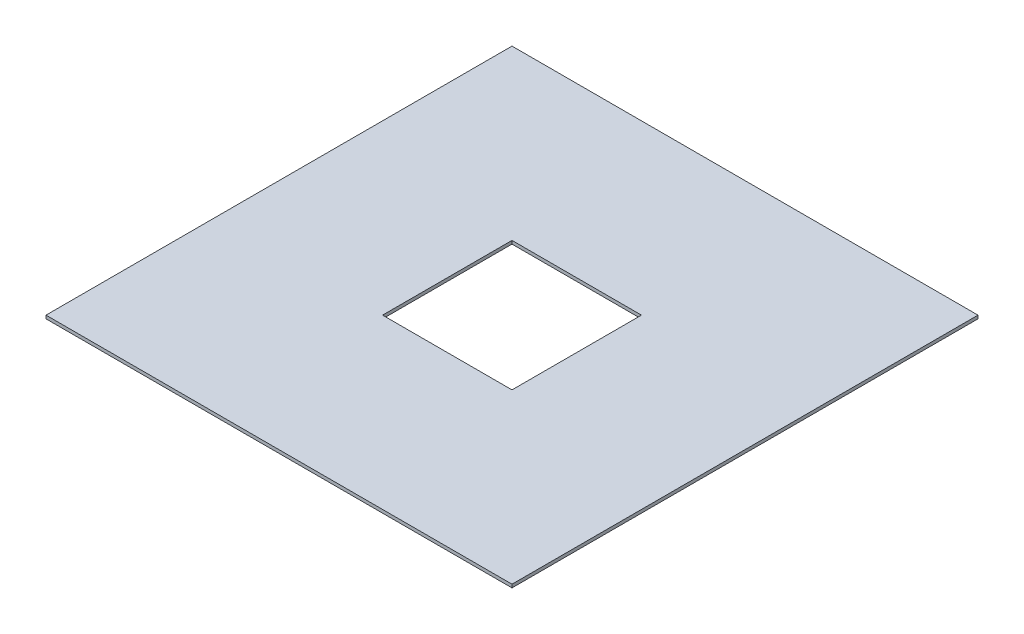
from build123d import *

# Parameters (mm, degrees)
SKETCH1_W           = 914.4
SKETCH1_H           = 914.4
BOSS_EXTRUDE1_DEPTH = 6.35
SKETCH2_W           = 254
SKETCH2_H           = 254
CUT_EXTRUDE1_DEPTH  = 647.60962141


with BuildPart() as part:
    # Sketch1 → Boss-Extrude1 (new body)
    with BuildSketch(Plane(origin=(0, 0, 0), x_dir=(1, 0, 0), z_dir=(0, 1, 0))):
        Rectangle(SKETCH1_W, SKETCH1_H)
    extrude(amount=BOSS_EXTRUDE1_DEPTH)

    # Sketch2 → Cut-Extrude1 (cut, through all)
    with BuildSketch(Plane(origin=(0, 6.35, 0), x_dir=(1, 0, 0), z_dir=(0, 1, 0))):
        Rectangle(SKETCH2_W, SKETCH2_H)
    extrude(amount=-CUT_EXTRUDE1_DEPTH, mode=Mode.SUBTRACT)


solid = part.part
